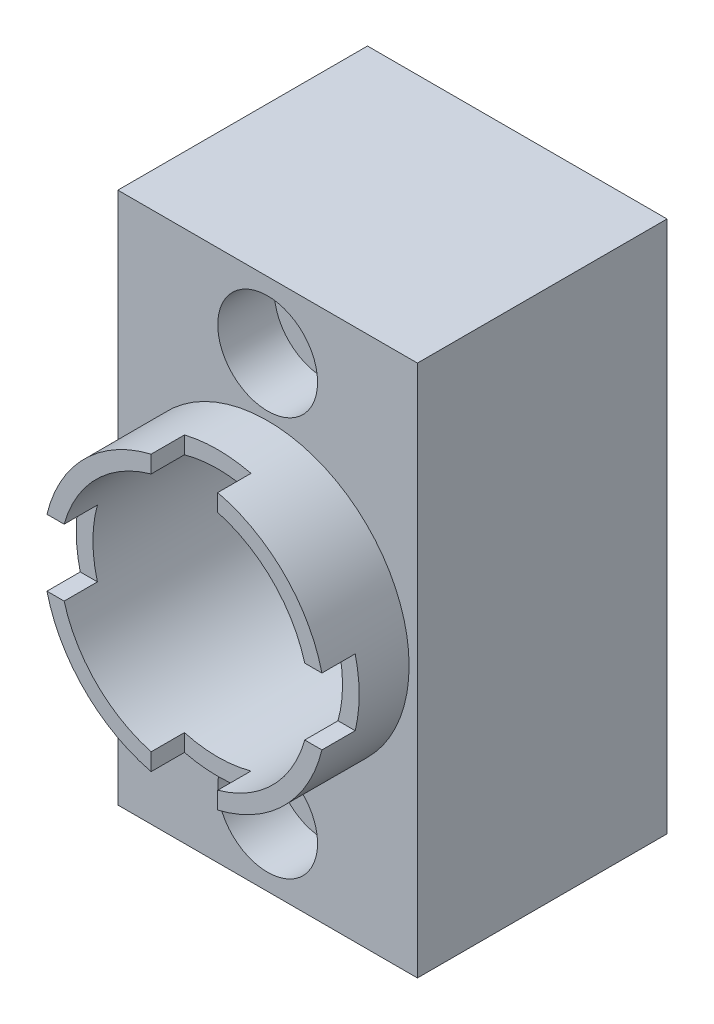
ISO-10303-21;
HEADER;
FILE_DESCRIPTION(('STEP AP214'),'2;1');
FILE_NAME('part.step','',(''),(''),'','','');
FILE_SCHEMA(('AUTOMOTIVE_DESIGN { 1 0 10303 214 1 1 1 1 }'));
ENDSEC;
DATA;
#1=APPLICATION_CONTEXT('core data for automotive mechanical design processes');
#2=APPLICATION_PROTOCOL_DEFINITION('international standard','automotive_design',2000,#1);
#3=PRODUCT_CONTEXT('',#1,'mechanical');
#4=PRODUCT('Part','Part','',(#3));
#5=PRODUCT_RELATED_PRODUCT_CATEGORY('part','',(#4));
#6=PRODUCT_DEFINITION_FORMATION('','',#4);
#7=PRODUCT_DEFINITION_CONTEXT('part definition',#1,'design');
#8=PRODUCT_DEFINITION('design','',#6,#7);
#9=PRODUCT_DEFINITION_SHAPE('','',#8);
#10=(LENGTH_UNIT() NAMED_UNIT(*) SI_UNIT(.MILLI.,.METRE.));
#11=(NAMED_UNIT(*) PLANE_ANGLE_UNIT() SI_UNIT($,.RADIAN.));
#12=(NAMED_UNIT(*) SI_UNIT($,.STERADIAN.) SOLID_ANGLE_UNIT());
#13=UNCERTAINTY_MEASURE_WITH_UNIT(LENGTH_MEASURE(1.E-05),#10,'distance_accuracy_value','');
#14=(GEOMETRIC_REPRESENTATION_CONTEXT(3) GLOBAL_UNCERTAINTY_ASSIGNED_CONTEXT((#13)) GLOBAL_UNIT_ASSIGNED_CONTEXT((#10,
#11,#12)) REPRESENTATION_CONTEXT('',''));
#15=CARTESIAN_POINT('',(0.,0.,0.));
#16=DIRECTION('',(0.,0.,1.));
#17=DIRECTION('',(1.,0.,0.));
#18=AXIS2_PLACEMENT_3D('',#15,#16,#17);
#19=CARTESIAN_POINT('',(0.,0.,20.));
#20=DIRECTION('',(0.,0.,-1.));
#21=DIRECTION('',(-1.,0.,0.));
#22=AXIS2_PLACEMENT_3D('',#19,#20,#21);
#23=PLANE('',#22);
#24=CARTESIAN_POINT('',(3.75000000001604,-1.20875531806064E-11,20.));
#25=DIRECTION('',(0.,0.,1.));
#26=DIRECTION('',(1.,0.,0.));
#27=AXIS2_PLACEMENT_3D('',#24,#25,#26);
#28=CIRCLE('',#27,8.49999999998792);
#29=CARTESIAN_POINT('',(12.0113558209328,1.99999999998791,20.));
#30=VERTEX_POINT('',#29);
#31=CARTESIAN_POINT('',(5.75000000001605,8.26135582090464,20.));
#32=VERTEX_POINT('',#31);
#33=EDGE_CURVE('E173',#30,#32,#28,.T.);
#34=ORIENTED_EDGE('',*,*,#33,.T.);
#35=DIRECTION('',(0.,1.,0.));
#36=VECTOR('',#35,1.);
#37=CARTESIAN_POINT('',(5.75000000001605,1.99999999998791,20.));
#38=LINE('',#37,#36);
#39=CARTESIAN_POINT('',(5.75000000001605,7.22841614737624,20.));
#40=VERTEX_POINT('',#39);
#41=EDGE_CURVE('E158',#40,#32,#38,.T.);
#42=ORIENTED_EDGE('',*,*,#41,.F.);
#43=CARTESIAN_POINT('',(3.75000000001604,-1.20875531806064E-11,20.));
#44=DIRECTION('',(0.,0.,1.));
#45=DIRECTION('',(1.,0.,0.));
#46=AXIS2_PLACEMENT_3D('',#43,#44,#45);
#47=CIRCLE('',#46,7.49999999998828);
#48=CARTESIAN_POINT('',(10.9784161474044,1.99999999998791,20.));
#49=VERTEX_POINT('',#48);
#50=EDGE_CURVE('E171',#49,#40,#47,.T.);
#51=ORIENTED_EDGE('',*,*,#50,.F.);
#52=DIRECTION('',(-1.,0.,0.));
#53=VECTOR('',#52,1.);
#54=CARTESIAN_POINT('',(5.75000000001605,1.99999999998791,20.));
#55=LINE('',#54,#53);
#56=EDGE_CURVE('E240',#30,#49,#55,.T.);
#57=ORIENTED_EDGE('',*,*,#56,.F.);
#58=EDGE_LOOP('',(#34,#42,#51,#57));
#59=FACE_BOUND('',#58,.T.);
#60=ADVANCED_FACE('F16',(#59),#23,.F.);
#61=CARTESIAN_POINT('',(5.75000000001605,-8.26135582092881,20.));
#62=VERTEX_POINT('',#61);
#63=CARTESIAN_POINT('',(12.0113558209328,-2.00000000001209,20.));
#64=VERTEX_POINT('',#63);
#65=EDGE_CURVE('E164',#62,#64,#28,.T.);
#66=ORIENTED_EDGE('',*,*,#65,.T.);
#67=DIRECTION('',(1.,0.,0.));
#68=VECTOR('',#67,1.);
#69=CARTESIAN_POINT('',(5.75000000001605,-2.00000000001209,20.));
#70=LINE('',#69,#68);
#71=CARTESIAN_POINT('',(10.9784161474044,-2.00000000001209,20.));
#72=VERTEX_POINT('',#71);
#73=EDGE_CURVE('E242',#72,#64,#70,.T.);
#74=ORIENTED_EDGE('',*,*,#73,.F.);
#75=CARTESIAN_POINT('',(5.75000000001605,-7.22841614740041,20.));
#76=VERTEX_POINT('',#75);
#77=EDGE_CURVE('E185',#76,#72,#47,.T.);
#78=ORIENTED_EDGE('',*,*,#77,.F.);
#79=DIRECTION('',(0.,1.,0.));
#80=VECTOR('',#79,1.);
#81=CARTESIAN_POINT('',(5.75000000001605,-9.47698460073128,20.));
#82=LINE('',#81,#80);
#83=EDGE_CURVE('E244',#62,#76,#82,.T.);
#84=ORIENTED_EDGE('',*,*,#83,.F.);
#85=EDGE_LOOP('',(#66,#74,#78,#84));
#86=FACE_BOUND('',#85,.T.);
#87=ADVANCED_FACE('F329',(#86),#23,.F.);
#88=CARTESIAN_POINT('',(-4.51135582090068,-2.00000000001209,20.));
#89=VERTEX_POINT('',#88);
#90=CARTESIAN_POINT('',(1.75000000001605,-8.26135582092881,20.));
#91=VERTEX_POINT('',#90);
#92=EDGE_CURVE('E365',#89,#91,#28,.T.);
#93=ORIENTED_EDGE('',*,*,#92,.T.);
#94=DIRECTION('',(0.,-1.,0.));
#95=VECTOR('',#94,1.);
#96=CARTESIAN_POINT('',(1.75000000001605,-9.47698460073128,20.));
#97=LINE('',#96,#95);
#98=CARTESIAN_POINT('',(1.75000000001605,-7.22841614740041,20.));
#99=VERTEX_POINT('',#98);
#100=EDGE_CURVE('E246',#99,#91,#97,.T.);
#101=ORIENTED_EDGE('',*,*,#100,.F.);
#102=CARTESIAN_POINT('',(-3.47841614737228,-2.00000000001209,20.));
#103=VERTEX_POINT('',#102);
#104=EDGE_CURVE('E190',#103,#99,#47,.T.);
#105=ORIENTED_EDGE('',*,*,#104,.F.);
#106=DIRECTION('',(1.,0.,0.));
#107=VECTOR('',#106,1.);
#108=CARTESIAN_POINT('',(-5.94728459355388,-2.00000000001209,20.));
#109=LINE('',#108,#107);
#110=EDGE_CURVE('E248',#89,#103,#109,.T.);
#111=ORIENTED_EDGE('',*,*,#110,.F.);
#112=EDGE_LOOP('',(#93,#101,#105,#111));
#113=FACE_BOUND('',#112,.T.);
#114=ADVANCED_FACE('F336',(#113),#23,.F.);
#115=CARTESIAN_POINT('',(12.7500000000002,-16.,20.));
#116=DIRECTION('',(-1.,0.,0.));
#117=DIRECTION('',(0.,0.,1.));
#118=AXIS2_PLACEMENT_3D('',#115,#116,#117);
#119=PLANE('',#118);
#120=DIRECTION('',(0.,0.,-1.));
#121=VECTOR('',#120,1.);
#122=CARTESIAN_POINT('',(12.7500000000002,16.,20.));
#123=LINE('',#122,#121);
#124=CARTESIAN_POINT('',(12.7500000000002,16.,15.));
#125=VERTEX_POINT('',#124);
#126=CARTESIAN_POINT('',(12.7500000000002,16.,0.));
#127=VERTEX_POINT('',#126);
#128=EDGE_CURVE('E437',#125,#127,#123,.T.);
#129=ORIENTED_EDGE('',*,*,#128,.F.);
#130=DIRECTION('',(0.,-1.,0.));
#131=VECTOR('',#130,1.);
#132=CARTESIAN_POINT('',(12.7500000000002,-16.,15.));
#133=LINE('',#132,#131);
#134=CARTESIAN_POINT('',(12.7500000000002,-16.,15.));
#135=VERTEX_POINT('',#134);
#136=EDGE_CURVE('E199',#125,#135,#133,.T.);
#137=ORIENTED_EDGE('',*,*,#136,.T.);
#138=DIRECTION('',(0.,0.,-1.));
#139=VECTOR('',#138,1.);
#140=CARTESIAN_POINT('',(12.7500000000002,-16.,20.));
#141=LINE('',#140,#139);
#142=CARTESIAN_POINT('',(12.7500000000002,-16.,0.));
#143=VERTEX_POINT('',#142);
#144=EDGE_CURVE('E431',#135,#143,#141,.T.);
#145=ORIENTED_EDGE('',*,*,#144,.T.);
#146=DIRECTION('',(0.,1.,0.));
#147=VECTOR('',#146,1.);
#148=CARTESIAN_POINT('',(12.7500000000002,-16.,0.));
#149=LINE('',#148,#147);
#150=EDGE_CURVE('E187',#143,#127,#149,.T.);
#151=ORIENTED_EDGE('',*,*,#150,.T.);
#152=EDGE_LOOP('',(#129,#137,#145,#151));
#153=FACE_BOUND('',#152,.T.);
#154=ADVANCED_FACE('F18',(#153),#119,.F.);
#155=CARTESIAN_POINT('',(-5.24999999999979,-16.,20.));
#156=DIRECTION('',(1.,0.,0.));
#157=DIRECTION('',(0.,0.,-1.));
#158=AXIS2_PLACEMENT_3D('',#155,#156,#157);
#159=PLANE('',#158);
#160=DIRECTION('',(0.,-1.,0.));
#161=VECTOR('',#160,1.);
#162=CARTESIAN_POINT('',(-5.24999999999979,-16.,15.));
#163=LINE('',#162,#161);
#164=CARTESIAN_POINT('',(-5.24999999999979,16.,15.));
#165=VERTEX_POINT('',#164);
#166=CARTESIAN_POINT('',(-5.24999999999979,-16.,15.));
#167=VERTEX_POINT('',#166);
#168=EDGE_CURVE('E205',#165,#167,#163,.T.);
#169=ORIENTED_EDGE('',*,*,#168,.F.);
#170=DIRECTION('',(0.,0.,-1.));
#171=VECTOR('',#170,1.);
#172=CARTESIAN_POINT('',(-5.24999999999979,16.,20.));
#173=LINE('',#172,#171);
#174=CARTESIAN_POINT('',(-5.24999999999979,16.,0.));
#175=VERTEX_POINT('',#174);
#176=EDGE_CURVE('E435',#165,#175,#173,.T.);
#177=ORIENTED_EDGE('',*,*,#176,.T.);
#178=DIRECTION('',(0.,-1.,0.));
#179=VECTOR('',#178,1.);
#180=CARTESIAN_POINT('',(-5.24999999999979,-16.,0.));
#181=LINE('',#180,#179);
#182=CARTESIAN_POINT('',(-5.24999999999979,-16.,0.));
#183=VERTEX_POINT('',#182);
#184=EDGE_CURVE('E425',#175,#183,#181,.T.);
#185=ORIENTED_EDGE('',*,*,#184,.T.);
#186=DIRECTION('',(0.,0.,-1.));
#187=VECTOR('',#186,1.);
#188=CARTESIAN_POINT('',(-5.24999999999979,-16.,20.));
#189=LINE('',#188,#187);
#190=EDGE_CURVE('E433',#167,#183,#189,.T.);
#191=ORIENTED_EDGE('',*,*,#190,.F.);
#192=EDGE_LOOP('',(#169,#177,#185,#191));
#193=FACE_BOUND('',#192,.T.);
#194=ADVANCED_FACE('F342',(#193),#159,.F.);
#195=CARTESIAN_POINT('',(1.75000000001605,8.26135582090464,20.));
#196=VERTEX_POINT('',#195);
#197=CARTESIAN_POINT('',(-4.51135582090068,1.99999999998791,20.));
#198=VERTEX_POINT('',#197);
#199=EDGE_CURVE('E214',#196,#198,#28,.T.);
#200=ORIENTED_EDGE('',*,*,#199,.T.);
#201=DIRECTION('',(-1.,0.,0.));
#202=VECTOR('',#201,1.);
#203=CARTESIAN_POINT('',(-5.94728459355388,1.99999999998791,20.));
#204=LINE('',#203,#202);
#205=CARTESIAN_POINT('',(-3.47841614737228,1.99999999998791,20.));
#206=VERTEX_POINT('',#205);
#207=EDGE_CURVE('E250',#206,#198,#204,.T.);
#208=ORIENTED_EDGE('',*,*,#207,.F.);
#209=CARTESIAN_POINT('',(1.75000000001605,7.22841614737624,20.));
#210=VERTEX_POINT('',#209);
#211=EDGE_CURVE('E183',#210,#206,#47,.T.);
#212=ORIENTED_EDGE('',*,*,#211,.F.);
#213=DIRECTION('',(0.,-1.,0.));
#214=VECTOR('',#213,1.);
#215=CARTESIAN_POINT('',(1.75000000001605,1.99999999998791,20.));
#216=LINE('',#215,#214);
#217=EDGE_CURVE('E174',#196,#210,#216,.T.);
#218=ORIENTED_EDGE('',*,*,#217,.F.);
#219=EDGE_LOOP('',(#200,#208,#212,#218));
#220=FACE_BOUND('',#219,.T.);
#221=ADVANCED_FACE('F331',(#220),#23,.F.);
#222=CARTESIAN_POINT('',(-5.24999999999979,16.,20.));
#223=DIRECTION('',(0.,-1.,0.));
#224=DIRECTION('',(0.,0.,-1.));
#225=AXIS2_PLACEMENT_3D('',#222,#223,#224);
#226=PLANE('',#225);
#227=ORIENTED_EDGE('',*,*,#176,.F.);
#228=DIRECTION('',(-1.,0.,0.));
#229=VECTOR('',#228,1.);
#230=CARTESIAN_POINT('',(12.7500000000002,16.,15.));
#231=LINE('',#230,#229);
#232=EDGE_CURVE('E208',#125,#165,#231,.T.);
#233=ORIENTED_EDGE('',*,*,#232,.F.);
#234=ORIENTED_EDGE('',*,*,#128,.T.);
#235=DIRECTION('',(-1.,0.,0.));
#236=VECTOR('',#235,1.);
#237=CARTESIAN_POINT('',(-5.24999999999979,16.,0.));
#238=LINE('',#237,#236);
#239=EDGE_CURVE('E423',#127,#175,#238,.T.);
#240=ORIENTED_EDGE('',*,*,#239,.T.);
#241=EDGE_LOOP('',(#227,#233,#234,#240));
#242=FACE_BOUND('',#241,.T.);
#243=ADVANCED_FACE('F341',(#242),#226,.F.);
#244=CARTESIAN_POINT('',(-5.24999999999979,-16.,20.));
#245=DIRECTION('',(0.,1.,0.));
#246=DIRECTION('',(0.,0.,1.));
#247=AXIS2_PLACEMENT_3D('',#244,#245,#246);
#248=PLANE('',#247);
#249=ORIENTED_EDGE('',*,*,#144,.F.);
#250=DIRECTION('',(-1.,0.,0.));
#251=VECTOR('',#250,1.);
#252=CARTESIAN_POINT('',(12.7500000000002,-16.,15.));
#253=LINE('',#252,#251);
#254=EDGE_CURVE('E193',#135,#167,#253,.T.);
#255=ORIENTED_EDGE('',*,*,#254,.T.);
#256=ORIENTED_EDGE('',*,*,#190,.T.);
#257=DIRECTION('',(1.,0.,0.));
#258=VECTOR('',#257,1.);
#259=CARTESIAN_POINT('',(-5.24999999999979,-16.,0.));
#260=LINE('',#259,#258);
#261=EDGE_CURVE('E421',#183,#143,#260,.T.);
#262=ORIENTED_EDGE('',*,*,#261,.T.);
#263=EDGE_LOOP('',(#249,#255,#256,#262));
#264=FACE_BOUND('',#263,.T.);
#265=ADVANCED_FACE('F349',(#264),#248,.F.);
#266=CARTESIAN_POINT('',(0.,0.,0.));
#267=DIRECTION('',(0.,0.,-1.));
#268=DIRECTION('',(-1.,0.,0.));
#269=AXIS2_PLACEMENT_3D('',#266,#267,#268);
#270=PLANE('',#269);
#271=CARTESIAN_POINT('',(3.75000000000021,-12.,0.));
#272=DIRECTION('',(0.,0.,-1.));
#273=DIRECTION('',(-1.,0.,0.));
#274=AXIS2_PLACEMENT_3D('',#271,#272,#273);
#275=CIRCLE('',#274,2.5);
#276=CARTESIAN_POINT('',(1.25000000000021,-12.,0.));
#277=VERTEX_POINT('',#276);
#278=EDGE_CURVE('E275',#277,#277,#275,.T.);
#279=ORIENTED_EDGE('',*,*,#278,.F.);
#280=EDGE_LOOP('',(#279));
#281=FACE_BOUND('',#280,.T.);
#282=CARTESIAN_POINT('',(3.75000000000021,12.,0.));
#283=DIRECTION('',(0.,0.,-1.));
#284=DIRECTION('',(-1.,0.,0.));
#285=AXIS2_PLACEMENT_3D('',#282,#283,#284);
#286=CIRCLE('',#285,2.5);
#287=CARTESIAN_POINT('',(1.25000000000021,12.,0.));
#288=VERTEX_POINT('',#287);
#289=EDGE_CURVE('E269',#288,#288,#286,.T.);
#290=ORIENTED_EDGE('',*,*,#289,.F.);
#291=EDGE_LOOP('',(#290));
#292=FACE_BOUND('',#291,.T.);
#293=CARTESIAN_POINT('',(3.75000000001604,-1.20875531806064E-11,0.));
#294=DIRECTION('',(0.,0.,1.));
#295=DIRECTION('',(1.,0.,0.));
#296=AXIS2_PLACEMENT_3D('',#293,#294,#295);
#297=CIRCLE('',#296,7.49999999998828);
#298=CARTESIAN_POINT('',(11.2500000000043,-1.20875531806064E-11,0.));
#299=VERTEX_POINT('',#298);
#300=EDGE_CURVE('E182',#299,#299,#297,.T.);
#301=ORIENTED_EDGE('',*,*,#300,.T.);
#302=EDGE_LOOP('',(#301));
#303=FACE_BOUND('',#302,.T.);
#304=ORIENTED_EDGE('',*,*,#150,.F.);
#305=ORIENTED_EDGE('',*,*,#261,.F.);
#306=ORIENTED_EDGE('',*,*,#184,.F.);
#307=ORIENTED_EDGE('',*,*,#239,.F.);
#308=EDGE_LOOP('',(#304,#305,#306,#307));
#309=FACE_BOUND('',#308,.T.);
#310=ADVANCED_FACE('F409',(#281,#292,#303,#309),#270,.T.);
#311=CARTESIAN_POINT('',(3.75000000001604,-1.20875531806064E-11,0.));
#312=DIRECTION('',(0.,0.,1.));
#313=DIRECTION('',(1.,0.,0.));
#314=AXIS2_PLACEMENT_3D('',#311,#312,#313);
#315=CYLINDRICAL_SURFACE('',#314,7.49999999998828);
#316=CARTESIAN_POINT('',(3.75000000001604,-1.20875531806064E-11,18.));
#317=DIRECTION('',(0.,0.,-1.));
#318=DIRECTION('',(-1.,0.,0.));
#319=AXIS2_PLACEMENT_3D('',#316,#317,#318);
#320=CIRCLE('',#319,7.49999999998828);
#321=CARTESIAN_POINT('',(1.75000000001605,-7.22841614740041,18.));
#322=VERTEX_POINT('',#321);
#323=CARTESIAN_POINT('',(5.75000000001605,-7.22841614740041,18.));
#324=VERTEX_POINT('',#323);
#325=EDGE_CURVE('E234',#322,#324,#320,.F.);
#326=ORIENTED_EDGE('',*,*,#325,.T.);
#327=DIRECTION('',(0.,0.,1.));
#328=VECTOR('',#327,1.);
#329=CARTESIAN_POINT('',(5.75000000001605,-7.22841614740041,0.));
#330=LINE('',#329,#328);
#331=EDGE_CURVE('E220',#324,#76,#330,.T.);
#332=ORIENTED_EDGE('',*,*,#331,.T.);
#333=ORIENTED_EDGE('',*,*,#77,.T.);
#334=DIRECTION('',(0.,0.,1.));
#335=VECTOR('',#334,1.);
#336=CARTESIAN_POINT('',(10.9784161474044,-2.00000000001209,0.));
#337=LINE('',#336,#335);
#338=CARTESIAN_POINT('',(10.9784161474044,-2.00000000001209,18.));
#339=VERTEX_POINT('',#338);
#340=EDGE_CURVE('E218',#72,#339,#337,.F.);
#341=ORIENTED_EDGE('',*,*,#340,.T.);
#342=CARTESIAN_POINT('',(10.9784161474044,1.99999999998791,18.));
#343=VERTEX_POINT('',#342);
#344=EDGE_CURVE('E457',#339,#343,#320,.F.);
#345=ORIENTED_EDGE('',*,*,#344,.T.);
#346=DIRECTION('',(0.,0.,1.));
#347=VECTOR('',#346,1.);
#348=CARTESIAN_POINT('',(10.9784161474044,1.99999999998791,0.));
#349=LINE('',#348,#347);
#350=EDGE_CURVE('E165',#343,#49,#349,.T.);
#351=ORIENTED_EDGE('',*,*,#350,.T.);
#352=ORIENTED_EDGE('',*,*,#50,.T.);
#353=DIRECTION('',(0.,0.,1.));
#354=VECTOR('',#353,1.);
#355=CARTESIAN_POINT('',(5.75000000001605,7.22841614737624,0.));
#356=LINE('',#355,#354);
#357=CARTESIAN_POINT('',(5.75000000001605,7.22841614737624,18.));
#358=VERTEX_POINT('',#357);
#359=EDGE_CURVE('E154',#40,#358,#356,.F.);
#360=ORIENTED_EDGE('',*,*,#359,.T.);
#361=CARTESIAN_POINT('',(1.75000000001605,7.22841614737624,18.));
#362=VERTEX_POINT('',#361);
#363=EDGE_CURVE('E238',#358,#362,#320,.F.);
#364=ORIENTED_EDGE('',*,*,#363,.T.);
#365=DIRECTION('',(0.,0.,1.));
#366=VECTOR('',#365,1.);
#367=CARTESIAN_POINT('',(1.75000000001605,7.22841614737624,0.));
#368=LINE('',#367,#366);
#369=EDGE_CURVE('E231',#362,#210,#368,.T.);
#370=ORIENTED_EDGE('',*,*,#369,.T.);
#371=ORIENTED_EDGE('',*,*,#211,.T.);
#372=DIRECTION('',(0.,0.,1.));
#373=VECTOR('',#372,1.);
#374=CARTESIAN_POINT('',(-3.47841614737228,1.99999999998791,0.));
#375=LINE('',#374,#373);
#376=CARTESIAN_POINT('',(-3.47841614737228,1.99999999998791,18.));
#377=VERTEX_POINT('',#376);
#378=EDGE_CURVE('E228',#206,#377,#375,.F.);
#379=ORIENTED_EDGE('',*,*,#378,.T.);
#380=CARTESIAN_POINT('',(-3.47841614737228,-2.00000000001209,18.));
#381=VERTEX_POINT('',#380);
#382=EDGE_CURVE('E235',#377,#381,#320,.F.);
#383=ORIENTED_EDGE('',*,*,#382,.T.);
#384=DIRECTION('',(0.,0.,1.));
#385=VECTOR('',#384,1.);
#386=CARTESIAN_POINT('',(-3.47841614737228,-2.00000000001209,0.));
#387=LINE('',#386,#385);
#388=EDGE_CURVE('E225',#381,#103,#387,.T.);
#389=ORIENTED_EDGE('',*,*,#388,.T.);
#390=ORIENTED_EDGE('',*,*,#104,.T.);
#391=DIRECTION('',(0.,0.,1.));
#392=VECTOR('',#391,1.);
#393=CARTESIAN_POINT('',(1.75000000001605,-7.22841614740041,0.));
#394=LINE('',#393,#392);
#395=EDGE_CURVE('E222',#99,#322,#394,.F.);
#396=ORIENTED_EDGE('',*,*,#395,.T.);
#397=EDGE_LOOP('',(#326,#332,#333,#341,#345,#351,#352,#360,#364,#370,#371,#379,#383,#389,#390,#396));
#398=FACE_BOUND('',#397,.T.);
#399=ORIENTED_EDGE('',*,*,#300,.F.);
#400=EDGE_LOOP('',(#399));
#401=FACE_BOUND('',#400,.T.);
#402=ADVANCED_FACE('F179',(#398,#401),#315,.F.);
#403=CARTESIAN_POINT('',(12.7500000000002,-16.,15.));
#404=DIRECTION('',(0.,0.,-1.));
#405=DIRECTION('',(-1.,0.,0.));
#406=AXIS2_PLACEMENT_3D('',#403,#404,#405);
#407=PLANE('',#406);
#408=CARTESIAN_POINT('',(3.75000000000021,-12.,15.));
#409=DIRECTION('',(0.,0.,1.));
#410=DIRECTION('',(1.,0.,0.));
#411=AXIS2_PLACEMENT_3D('',#408,#409,#410);
#412=CIRCLE('',#411,3.);
#413=CARTESIAN_POINT('',(6.75000000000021,-12.,15.));
#414=VERTEX_POINT('',#413);
#415=EDGE_CURVE('E296',#414,#414,#412,.T.);
#416=ORIENTED_EDGE('',*,*,#415,.F.);
#417=EDGE_LOOP('',(#416));
#418=FACE_BOUND('',#417,.T.);
#419=CARTESIAN_POINT('',(3.75000000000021,12.,15.));
#420=DIRECTION('',(0.,0.,1.));
#421=DIRECTION('',(1.,0.,0.));
#422=AXIS2_PLACEMENT_3D('',#419,#420,#421);
#423=CIRCLE('',#422,3.);
#424=CARTESIAN_POINT('',(6.75000000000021,12.,15.));
#425=VERTEX_POINT('',#424);
#426=EDGE_CURVE('E287',#425,#425,#423,.T.);
#427=ORIENTED_EDGE('',*,*,#426,.F.);
#428=EDGE_LOOP('',(#427));
#429=FACE_BOUND('',#428,.T.);
#430=ORIENTED_EDGE('',*,*,#168,.T.);
#431=ORIENTED_EDGE('',*,*,#254,.F.);
#432=ORIENTED_EDGE('',*,*,#136,.F.);
#433=ORIENTED_EDGE('',*,*,#232,.T.);
#434=EDGE_LOOP('',(#430,#431,#432,#433));
#435=FACE_BOUND('',#434,.T.);
#436=CARTESIAN_POINT('',(3.75000000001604,-1.20875531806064E-11,15.));
#437=DIRECTION('',(0.,0.,1.));
#438=DIRECTION('',(1.,0.,0.));
#439=AXIS2_PLACEMENT_3D('',#436,#437,#438);
#440=CIRCLE('',#439,8.49999999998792);
#441=CARTESIAN_POINT('',(12.250000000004,-1.20875531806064E-11,15.));
#442=VERTEX_POINT('',#441);
#443=EDGE_CURVE('E212',#442,#442,#440,.T.);
#444=ORIENTED_EDGE('',*,*,#443,.F.);
#445=EDGE_LOOP('',(#444));
#446=FACE_BOUND('',#445,.T.);
#447=ADVANCED_FACE('F302',(#418,#429,#435,#446),#407,.F.);
#448=CARTESIAN_POINT('',(3.75000000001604,-1.20875531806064E-11,15.));
#449=DIRECTION('',(0.,0.,1.));
#450=DIRECTION('',(1.,0.,0.));
#451=AXIS2_PLACEMENT_3D('',#448,#449,#450);
#452=CYLINDRICAL_SURFACE('',#451,8.49999999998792);
#453=DIRECTION('',(0.,0.,1.));
#454=VECTOR('',#453,1.);
#455=CARTESIAN_POINT('',(5.75000000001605,-8.26135582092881,15.));
#456=LINE('',#455,#454);
#457=CARTESIAN_POINT('',(5.75000000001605,-8.26135582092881,18.));
#458=VERTEX_POINT('',#457);
#459=EDGE_CURVE('E11',#458,#62,#456,.T.);
#460=ORIENTED_EDGE('',*,*,#459,.F.);
#461=CARTESIAN_POINT('',(3.75000000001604,-1.20875531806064E-11,18.));
#462=DIRECTION('',(0.,0.,-1.));
#463=DIRECTION('',(-1.,0.,0.));
#464=AXIS2_PLACEMENT_3D('',#461,#462,#463);
#465=CIRCLE('',#464,8.49999999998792);
#466=CARTESIAN_POINT('',(1.75000000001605,-8.26135582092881,18.));
#467=VERTEX_POINT('',#466);
#468=EDGE_CURVE('E382',#467,#458,#465,.F.);
#469=ORIENTED_EDGE('',*,*,#468,.F.);
#470=DIRECTION('',(0.,0.,1.));
#471=VECTOR('',#470,1.);
#472=CARTESIAN_POINT('',(1.75000000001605,-8.26135582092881,15.));
#473=LINE('',#472,#471);
#474=EDGE_CURVE('E25',#91,#467,#473,.F.);
#475=ORIENTED_EDGE('',*,*,#474,.F.);
#476=ORIENTED_EDGE('',*,*,#92,.F.);
#477=DIRECTION('',(0.,0.,1.));
#478=VECTOR('',#477,1.);
#479=CARTESIAN_POINT('',(-4.51135582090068,-2.00000000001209,15.));
#480=LINE('',#479,#478);
#481=CARTESIAN_POINT('',(-4.51135582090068,-2.00000000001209,18.));
#482=VERTEX_POINT('',#481);
#483=EDGE_CURVE('E443',#482,#89,#480,.T.);
#484=ORIENTED_EDGE('',*,*,#483,.F.);
#485=CARTESIAN_POINT('',(-4.51135582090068,1.99999999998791,18.));
#486=VERTEX_POINT('',#485);
#487=EDGE_CURVE('E438',#486,#482,#465,.F.);
#488=ORIENTED_EDGE('',*,*,#487,.F.);
#489=DIRECTION('',(0.,0.,1.));
#490=VECTOR('',#489,1.);
#491=CARTESIAN_POINT('',(-4.51135582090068,1.99999999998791,15.));
#492=LINE('',#491,#490);
#493=EDGE_CURVE('E440',#198,#486,#492,.F.);
#494=ORIENTED_EDGE('',*,*,#493,.F.);
#495=ORIENTED_EDGE('',*,*,#199,.F.);
#496=DIRECTION('',(0.,0.,1.));
#497=VECTOR('',#496,1.);
#498=CARTESIAN_POINT('',(1.75000000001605,8.26135582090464,15.));
#499=LINE('',#498,#497);
#500=CARTESIAN_POINT('',(1.75000000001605,8.26135582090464,18.));
#501=VERTEX_POINT('',#500);
#502=EDGE_CURVE('E444',#501,#196,#499,.T.);
#503=ORIENTED_EDGE('',*,*,#502,.F.);
#504=CARTESIAN_POINT('',(5.75000000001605,8.26135582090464,18.));
#505=VERTEX_POINT('',#504);
#506=EDGE_CURVE('E386',#505,#501,#465,.F.);
#507=ORIENTED_EDGE('',*,*,#506,.F.);
#508=DIRECTION('',(0.,0.,1.));
#509=VECTOR('',#508,1.);
#510=CARTESIAN_POINT('',(5.75000000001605,8.26135582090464,15.));
#511=LINE('',#510,#509);
#512=EDGE_CURVE('E384',#32,#505,#511,.F.);
#513=ORIENTED_EDGE('',*,*,#512,.F.);
#514=ORIENTED_EDGE('',*,*,#33,.F.);
#515=DIRECTION('',(0.,0.,1.));
#516=VECTOR('',#515,1.);
#517=CARTESIAN_POINT('',(12.0113558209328,1.99999999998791,15.));
#518=LINE('',#517,#516);
#519=CARTESIAN_POINT('',(12.0113558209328,1.99999999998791,18.));
#520=VERTEX_POINT('',#519);
#521=EDGE_CURVE('E380',#520,#30,#518,.T.);
#522=ORIENTED_EDGE('',*,*,#521,.F.);
#523=CARTESIAN_POINT('',(12.0113558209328,-2.00000000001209,18.));
#524=VERTEX_POINT('',#523);
#525=EDGE_CURVE('E378',#524,#520,#465,.F.);
#526=ORIENTED_EDGE('',*,*,#525,.F.);
#527=DIRECTION('',(0.,0.,1.));
#528=VECTOR('',#527,1.);
#529=CARTESIAN_POINT('',(12.0113558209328,-2.00000000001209,15.));
#530=LINE('',#529,#528);
#531=EDGE_CURVE('E376',#64,#524,#530,.F.);
#532=ORIENTED_EDGE('',*,*,#531,.F.);
#533=ORIENTED_EDGE('',*,*,#65,.F.);
#534=EDGE_LOOP('',(#460,#469,#475,#476,#484,#488,#494,#495,#503,#507,#513,#514,#522,#526,#532,#533));
#535=FACE_BOUND('',#534,.T.);
#536=ORIENTED_EDGE('',*,*,#443,.T.);
#537=EDGE_LOOP('',(#536));
#538=FACE_BOUND('',#537,.T.);
#539=ADVANCED_FACE('F305',(#535,#538),#452,.T.);
#540=CARTESIAN_POINT('',(0.,0.,18.));
#541=DIRECTION('',(0.,0.,-1.));
#542=DIRECTION('',(-1.,0.,0.));
#543=AXIS2_PLACEMENT_3D('',#540,#541,#542);
#544=PLANE('',#543);
#545=DIRECTION('',(-1.,0.,0.));
#546=VECTOR('',#545,1.);
#547=CARTESIAN_POINT('',(-5.94728459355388,1.99999999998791,18.));
#548=LINE('',#547,#546);
#549=EDGE_CURVE('E263',#377,#486,#548,.T.);
#550=ORIENTED_EDGE('',*,*,#549,.T.);
#551=ORIENTED_EDGE('',*,*,#487,.T.);
#552=DIRECTION('',(1.,0.,0.));
#553=VECTOR('',#552,1.);
#554=CARTESIAN_POINT('',(-5.94728459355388,-2.00000000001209,18.));
#555=LINE('',#554,#553);
#556=EDGE_CURVE('E260',#482,#381,#555,.T.);
#557=ORIENTED_EDGE('',*,*,#556,.T.);
#558=ORIENTED_EDGE('',*,*,#382,.F.);
#559=EDGE_LOOP('',(#550,#551,#557,#558));
#560=FACE_BOUND('',#559,.T.);
#561=ADVANCED_FACE('F313',(#560),#544,.F.);
#562=CARTESIAN_POINT('',(-5.94728459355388,1.99999999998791,18.));
#563=DIRECTION('',(0.,1.,0.));
#564=DIRECTION('',(0.,0.,1.));
#565=AXIS2_PLACEMENT_3D('',#562,#563,#564);
#566=PLANE('',#565);
#567=ORIENTED_EDGE('',*,*,#207,.T.);
#568=ORIENTED_EDGE('',*,*,#493,.T.);
#569=ORIENTED_EDGE('',*,*,#549,.F.);
#570=ORIENTED_EDGE('',*,*,#378,.F.);
#571=EDGE_LOOP('',(#567,#568,#569,#570));
#572=FACE_BOUND('',#571,.T.);
#573=ADVANCED_FACE('F321',(#572),#566,.F.);
#574=CARTESIAN_POINT('',(-5.94728459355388,-2.00000000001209,18.));
#575=DIRECTION('',(0.,-1.,0.));
#576=DIRECTION('',(0.,0.,-1.));
#577=AXIS2_PLACEMENT_3D('',#574,#575,#576);
#578=PLANE('',#577);
#579=ORIENTED_EDGE('',*,*,#556,.F.);
#580=ORIENTED_EDGE('',*,*,#483,.T.);
#581=ORIENTED_EDGE('',*,*,#110,.T.);
#582=ORIENTED_EDGE('',*,*,#388,.F.);
#583=EDGE_LOOP('',(#579,#580,#581,#582));
#584=FACE_BOUND('',#583,.T.);
#585=ADVANCED_FACE('F477',(#584),#578,.F.);
#586=DIRECTION('',(0.,1.,0.));
#587=VECTOR('',#586,1.);
#588=CARTESIAN_POINT('',(5.75000000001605,1.99999999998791,18.));
#589=LINE('',#588,#587);
#590=EDGE_CURVE('E160',#358,#505,#589,.T.);
#591=ORIENTED_EDGE('',*,*,#590,.T.);
#592=ORIENTED_EDGE('',*,*,#506,.T.);
#593=DIRECTION('',(0.,-1.,0.));
#594=VECTOR('',#593,1.);
#595=CARTESIAN_POINT('',(1.75000000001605,1.99999999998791,18.));
#596=LINE('',#595,#594);
#597=EDGE_CURVE('E265',#501,#362,#596,.T.);
#598=ORIENTED_EDGE('',*,*,#597,.T.);
#599=ORIENTED_EDGE('',*,*,#363,.F.);
#600=EDGE_LOOP('',(#591,#592,#598,#599));
#601=FACE_BOUND('',#600,.T.);
#602=ADVANCED_FACE('F325',(#601),#544,.F.);
#603=CARTESIAN_POINT('',(1.75000000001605,1.99999999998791,18.));
#604=DIRECTION('',(-1.,0.,0.));
#605=DIRECTION('',(0.,0.,1.));
#606=AXIS2_PLACEMENT_3D('',#603,#604,#605);
#607=PLANE('',#606);
#608=ORIENTED_EDGE('',*,*,#597,.F.);
#609=ORIENTED_EDGE('',*,*,#502,.T.);
#610=ORIENTED_EDGE('',*,*,#217,.T.);
#611=ORIENTED_EDGE('',*,*,#369,.F.);
#612=EDGE_LOOP('',(#608,#609,#610,#611));
#613=FACE_BOUND('',#612,.T.);
#614=ADVANCED_FACE('F451',(#613),#607,.F.);
#615=CARTESIAN_POINT('',(5.75000000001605,1.99999999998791,18.));
#616=DIRECTION('',(1.,0.,0.));
#617=DIRECTION('',(0.,0.,-1.));
#618=AXIS2_PLACEMENT_3D('',#615,#616,#617);
#619=PLANE('',#618);
#620=ORIENTED_EDGE('',*,*,#41,.T.);
#621=ORIENTED_EDGE('',*,*,#512,.T.);
#622=ORIENTED_EDGE('',*,*,#590,.F.);
#623=ORIENTED_EDGE('',*,*,#359,.F.);
#624=EDGE_LOOP('',(#620,#621,#622,#623));
#625=FACE_BOUND('',#624,.T.);
#626=ADVANCED_FACE('F156',(#625),#619,.F.);
#627=DIRECTION('',(1.,0.,0.));
#628=VECTOR('',#627,1.);
#629=CARTESIAN_POINT('',(5.75000000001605,-2.00000000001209,18.));
#630=LINE('',#629,#628);
#631=EDGE_CURVE('E41',#339,#524,#630,.T.);
#632=ORIENTED_EDGE('',*,*,#631,.T.);
#633=ORIENTED_EDGE('',*,*,#525,.T.);
#634=DIRECTION('',(-1.,0.,0.));
#635=VECTOR('',#634,1.);
#636=CARTESIAN_POINT('',(5.75000000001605,1.99999999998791,18.));
#637=LINE('',#636,#635);
#638=EDGE_CURVE('E239',#520,#343,#637,.T.);
#639=ORIENTED_EDGE('',*,*,#638,.T.);
#640=ORIENTED_EDGE('',*,*,#344,.F.);
#641=EDGE_LOOP('',(#632,#633,#639,#640));
#642=FACE_BOUND('',#641,.T.);
#643=ADVANCED_FACE('F486',(#642),#544,.F.);
#644=CARTESIAN_POINT('',(5.75000000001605,-2.00000000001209,18.));
#645=DIRECTION('',(0.,-1.,0.));
#646=DIRECTION('',(0.,0.,-1.));
#647=AXIS2_PLACEMENT_3D('',#644,#645,#646);
#648=PLANE('',#647);
#649=ORIENTED_EDGE('',*,*,#73,.T.);
#650=ORIENTED_EDGE('',*,*,#531,.T.);
#651=ORIENTED_EDGE('',*,*,#631,.F.);
#652=ORIENTED_EDGE('',*,*,#340,.F.);
#653=EDGE_LOOP('',(#649,#650,#651,#652));
#654=FACE_BOUND('',#653,.T.);
#655=ADVANCED_FACE('F472',(#654),#648,.F.);
#656=CARTESIAN_POINT('',(5.75000000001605,1.99999999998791,18.));
#657=DIRECTION('',(0.,1.,0.));
#658=DIRECTION('',(0.,0.,1.));
#659=AXIS2_PLACEMENT_3D('',#656,#657,#658);
#660=PLANE('',#659);
#661=ORIENTED_EDGE('',*,*,#638,.F.);
#662=ORIENTED_EDGE('',*,*,#521,.T.);
#663=ORIENTED_EDGE('',*,*,#56,.T.);
#664=ORIENTED_EDGE('',*,*,#350,.F.);
#665=EDGE_LOOP('',(#661,#662,#663,#664));
#666=FACE_BOUND('',#665,.T.);
#667=ADVANCED_FACE('F464',(#666),#660,.F.);
#668=CARTESIAN_POINT('',(5.75000000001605,-9.47698460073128,18.));
#669=DIRECTION('',(1.,0.,0.));
#670=DIRECTION('',(0.,0.,-1.));
#671=AXIS2_PLACEMENT_3D('',#668,#669,#670);
#672=PLANE('',#671);
#673=DIRECTION('',(0.,1.,0.));
#674=VECTOR('',#673,1.);
#675=CARTESIAN_POINT('',(5.75000000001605,-9.47698460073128,18.));
#676=LINE('',#675,#674);
#677=EDGE_CURVE('E256',#458,#324,#676,.T.);
#678=ORIENTED_EDGE('',*,*,#677,.F.);
#679=ORIENTED_EDGE('',*,*,#459,.T.);
#680=ORIENTED_EDGE('',*,*,#83,.T.);
#681=ORIENTED_EDGE('',*,*,#331,.F.);
#682=EDGE_LOOP('',(#678,#679,#680,#681));
#683=FACE_BOUND('',#682,.T.);
#684=ADVANCED_FACE('F462',(#683),#672,.F.);
#685=CARTESIAN_POINT('',(1.75000000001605,-9.47698460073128,18.));
#686=DIRECTION('',(-1.,0.,0.));
#687=DIRECTION('',(0.,0.,1.));
#688=AXIS2_PLACEMENT_3D('',#685,#686,#687);
#689=PLANE('',#688);
#690=ORIENTED_EDGE('',*,*,#100,.T.);
#691=ORIENTED_EDGE('',*,*,#474,.T.);
#692=DIRECTION('',(0.,-1.,0.));
#693=VECTOR('',#692,1.);
#694=CARTESIAN_POINT('',(1.75000000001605,-9.47698460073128,18.));
#695=LINE('',#694,#693);
#696=EDGE_CURVE('E33',#322,#467,#695,.T.);
#697=ORIENTED_EDGE('',*,*,#696,.F.);
#698=ORIENTED_EDGE('',*,*,#395,.F.);
#699=EDGE_LOOP('',(#690,#691,#697,#698));
#700=FACE_BOUND('',#699,.T.);
#701=ADVANCED_FACE('F460',(#700),#689,.F.);
#702=ORIENTED_EDGE('',*,*,#696,.T.);
#703=ORIENTED_EDGE('',*,*,#468,.T.);
#704=ORIENTED_EDGE('',*,*,#677,.T.);
#705=ORIENTED_EDGE('',*,*,#325,.F.);
#706=EDGE_LOOP('',(#702,#703,#704,#705));
#707=FACE_BOUND('',#706,.T.);
#708=ADVANCED_FACE('F324',(#707),#544,.F.);
#709=CARTESIAN_POINT('',(3.75000000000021,12.,2.));
#710=DIRECTION('',(0.,0.,-1.));
#711=DIRECTION('',(-1.,0.,0.));
#712=AXIS2_PLACEMENT_3D('',#709,#710,#711);
#713=CYLINDRICAL_SURFACE('',#712,2.5);
#714=CARTESIAN_POINT('',(3.75000000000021,12.,2.));
#715=DIRECTION('',(0.,0.,-1.));
#716=DIRECTION('',(-1.,0.,0.));
#717=AXIS2_PLACEMENT_3D('',#714,#715,#716);
#718=CIRCLE('',#717,2.5);
#719=CARTESIAN_POINT('',(1.25000000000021,12.,2.));
#720=VERTEX_POINT('',#719);
#721=EDGE_CURVE('E175',#720,#720,#718,.T.);
#722=ORIENTED_EDGE('',*,*,#721,.F.);
#723=EDGE_LOOP('',(#722));
#724=FACE_BOUND('',#723,.T.);
#725=ORIENTED_EDGE('',*,*,#289,.T.);
#726=EDGE_LOOP('',(#725));
#727=FACE_BOUND('',#726,.T.);
#728=ADVANCED_FACE('F400',(#724,#727),#713,.F.);
#729=CARTESIAN_POINT('',(3.75000000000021,12.,2.));
#730=DIRECTION('',(0.,0.,-1.));
#731=DIRECTION('',(-1.,0.,0.));
#732=AXIS2_PLACEMENT_3D('',#729,#730,#731);
#733=PLANE('',#732);
#734=CARTESIAN_POINT('',(3.75000000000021,12.,2.));
#735=DIRECTION('',(0.,0.,-1.));
#736=DIRECTION('',(-1.,0.,0.));
#737=AXIS2_PLACEMENT_3D('',#734,#735,#736);
#738=CIRCLE('',#737,1.7);
#739=CARTESIAN_POINT('',(2.05000000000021,12.,2.));
#740=VERTEX_POINT('',#739);
#741=EDGE_CURVE('E278',#740,#740,#738,.T.);
#742=ORIENTED_EDGE('',*,*,#741,.F.);
#743=EDGE_LOOP('',(#742));
#744=FACE_BOUND('',#743,.T.);
#745=ORIENTED_EDGE('',*,*,#721,.T.);
#746=EDGE_LOOP('',(#745));
#747=FACE_BOUND('',#746,.T.);
#748=ADVANCED_FACE('F396',(#744,#747),#733,.T.);
#749=CARTESIAN_POINT('',(3.75000000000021,-12.,2.));
#750=DIRECTION('',(0.,0.,-1.));
#751=DIRECTION('',(-1.,0.,0.));
#752=AXIS2_PLACEMENT_3D('',#749,#750,#751);
#753=CYLINDRICAL_SURFACE('',#752,2.5);
#754=CARTESIAN_POINT('',(3.75000000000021,-12.,2.));
#755=DIRECTION('',(0.,0.,-1.));
#756=DIRECTION('',(-1.,0.,0.));
#757=AXIS2_PLACEMENT_3D('',#754,#755,#756);
#758=CIRCLE('',#757,2.5);
#759=CARTESIAN_POINT('',(1.25000000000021,-12.,2.));
#760=VERTEX_POINT('',#759);
#761=EDGE_CURVE('E272',#760,#760,#758,.T.);
#762=ORIENTED_EDGE('',*,*,#761,.F.);
#763=EDGE_LOOP('',(#762));
#764=FACE_BOUND('',#763,.T.);
#765=ORIENTED_EDGE('',*,*,#278,.T.);
#766=EDGE_LOOP('',(#765));
#767=FACE_BOUND('',#766,.T.);
#768=ADVANCED_FACE('F399',(#764,#767),#753,.F.);
#769=CARTESIAN_POINT('',(3.75000000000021,-12.,2.));
#770=DIRECTION('',(0.,0.,-1.));
#771=DIRECTION('',(-1.,0.,0.));
#772=AXIS2_PLACEMENT_3D('',#769,#770,#771);
#773=PLANE('',#772);
#774=CARTESIAN_POINT('',(3.75000000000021,-12.,2.));
#775=DIRECTION('',(0.,0.,-1.));
#776=DIRECTION('',(-1.,0.,0.));
#777=AXIS2_PLACEMENT_3D('',#774,#775,#776);
#778=CIRCLE('',#777,1.7);
#779=CARTESIAN_POINT('',(2.05000000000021,-12.,2.));
#780=VERTEX_POINT('',#779);
#781=EDGE_CURVE('E20',#780,#780,#778,.T.);
#782=ORIENTED_EDGE('',*,*,#781,.F.);
#783=EDGE_LOOP('',(#782));
#784=FACE_BOUND('',#783,.T.);
#785=ORIENTED_EDGE('',*,*,#761,.T.);
#786=EDGE_LOOP('',(#785));
#787=FACE_BOUND('',#786,.T.);
#788=ADVANCED_FACE('F523',(#784,#787),#773,.T.);
#789=CARTESIAN_POINT('',(3.75000000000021,12.,15.));
#790=DIRECTION('',(0.,0.,1.));
#791=DIRECTION('',(1.,0.,0.));
#792=AXIS2_PLACEMENT_3D('',#789,#790,#791);
#793=CYLINDRICAL_SURFACE('',#792,1.7);
#794=ORIENTED_EDGE('',*,*,#741,.T.);
#795=EDGE_LOOP('',(#794));
#796=FACE_BOUND('',#795,.T.);
#797=CARTESIAN_POINT('',(3.75000000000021,12.,11.6));
#798=DIRECTION('',(0.,0.,1.));
#799=DIRECTION('',(1.,0.,0.));
#800=AXIS2_PLACEMENT_3D('',#797,#798,#799);
#801=CIRCLE('',#800,1.7);
#802=CARTESIAN_POINT('',(5.45000000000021,12.,11.6));
#803=VERTEX_POINT('',#802);
#804=EDGE_CURVE('E281',#803,#803,#801,.T.);
#805=ORIENTED_EDGE('',*,*,#804,.T.);
#806=EDGE_LOOP('',(#805));
#807=FACE_BOUND('',#806,.T.);
#808=ADVANCED_FACE('F393',(#796,#807),#793,.F.);
#809=CARTESIAN_POINT('',(5.45000000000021,12.,11.6));
#810=DIRECTION('',(0.,0.,-1.));
#811=DIRECTION('',(-1.,0.,0.));
#812=AXIS2_PLACEMENT_3D('',#809,#810,#811);
#813=PLANE('',#812);
#814=ORIENTED_EDGE('',*,*,#804,.F.);
#815=EDGE_LOOP('',(#814));
#816=FACE_BOUND('',#815,.T.);
#817=CARTESIAN_POINT('',(3.75000000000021,12.,11.6));
#818=DIRECTION('',(0.,0.,1.));
#819=DIRECTION('',(1.,0.,0.));
#820=AXIS2_PLACEMENT_3D('',#817,#818,#819);
#821=CIRCLE('',#820,3.);
#822=CARTESIAN_POINT('',(6.75000000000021,12.,11.6));
#823=VERTEX_POINT('',#822);
#824=EDGE_CURVE('E284',#823,#823,#821,.T.);
#825=ORIENTED_EDGE('',*,*,#824,.T.);
#826=EDGE_LOOP('',(#825));
#827=FACE_BOUND('',#826,.T.);
#828=ADVANCED_FACE('F540',(#816,#827),#813,.F.);
#829=CARTESIAN_POINT('',(3.75000000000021,12.,15.));
#830=DIRECTION('',(0.,0.,1.));
#831=DIRECTION('',(1.,0.,0.));
#832=AXIS2_PLACEMENT_3D('',#829,#830,#831);
#833=CYLINDRICAL_SURFACE('',#832,3.);
#834=ORIENTED_EDGE('',*,*,#824,.F.);
#835=EDGE_LOOP('',(#834));
#836=FACE_BOUND('',#835,.T.);
#837=ORIENTED_EDGE('',*,*,#426,.T.);
#838=EDGE_LOOP('',(#837));
#839=FACE_BOUND('',#838,.T.);
#840=ADVANCED_FACE('F548',(#836,#839),#833,.F.);
#841=CARTESIAN_POINT('',(3.75000000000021,-12.,15.));
#842=DIRECTION('',(0.,0.,1.));
#843=DIRECTION('',(1.,0.,0.));
#844=AXIS2_PLACEMENT_3D('',#841,#842,#843);
#845=CYLINDRICAL_SURFACE('',#844,1.7);
#846=ORIENTED_EDGE('',*,*,#781,.T.);
#847=EDGE_LOOP('',(#846));
#848=FACE_BOUND('',#847,.T.);
#849=CARTESIAN_POINT('',(3.75000000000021,-12.,11.6));
#850=DIRECTION('',(0.,0.,1.));
#851=DIRECTION('',(1.,0.,0.));
#852=AXIS2_PLACEMENT_3D('',#849,#850,#851);
#853=CIRCLE('',#852,1.7);
#854=CARTESIAN_POINT('',(5.45000000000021,-12.,11.6));
#855=VERTEX_POINT('',#854);
#856=EDGE_CURVE('E290',#855,#855,#853,.T.);
#857=ORIENTED_EDGE('',*,*,#856,.T.);
#858=EDGE_LOOP('',(#857));
#859=FACE_BOUND('',#858,.T.);
#860=ADVANCED_FACE('F557',(#848,#859),#845,.F.);
#861=CARTESIAN_POINT('',(5.45000000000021,-12.,11.6));
#862=DIRECTION('',(0.,0.,-1.));
#863=DIRECTION('',(-1.,0.,0.));
#864=AXIS2_PLACEMENT_3D('',#861,#862,#863);
#865=PLANE('',#864);
#866=ORIENTED_EDGE('',*,*,#856,.F.);
#867=EDGE_LOOP('',(#866));
#868=FACE_BOUND('',#867,.T.);
#869=CARTESIAN_POINT('',(3.75000000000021,-12.,11.6));
#870=DIRECTION('',(0.,0.,1.));
#871=DIRECTION('',(1.,0.,0.));
#872=AXIS2_PLACEMENT_3D('',#869,#870,#871);
#873=CIRCLE('',#872,3.);
#874=CARTESIAN_POINT('',(6.75000000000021,-12.,11.6));
#875=VERTEX_POINT('',#874);
#876=EDGE_CURVE('E293',#875,#875,#873,.T.);
#877=ORIENTED_EDGE('',*,*,#876,.T.);
#878=EDGE_LOOP('',(#877));
#879=FACE_BOUND('',#878,.T.);
#880=ADVANCED_FACE('F566',(#868,#879),#865,.F.);
#881=CARTESIAN_POINT('',(3.75000000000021,-12.,15.));
#882=DIRECTION('',(0.,0.,1.));
#883=DIRECTION('',(1.,0.,0.));
#884=AXIS2_PLACEMENT_3D('',#881,#882,#883);
#885=CYLINDRICAL_SURFACE('',#884,3.);
#886=ORIENTED_EDGE('',*,*,#876,.F.);
#887=EDGE_LOOP('',(#886));
#888=FACE_BOUND('',#887,.T.);
#889=ORIENTED_EDGE('',*,*,#415,.T.);
#890=EDGE_LOOP('',(#889));
#891=FACE_BOUND('',#890,.T.);
#892=ADVANCED_FACE('F300',(#888,#891),#885,.F.);
#893=CLOSED_SHELL('',(#60,#87,#114,#154,#194,#221,#243,#265,#310,#402,#447,#539,#561,#573,#585,
#602,#614,#626,#643,#655,#667,#684,#701,#708,#728,#748,#768,#788,#808,#828,#840,#860,#880,#892));
#894=MANIFOLD_SOLID_BREP('B1',#893);
#895=ADVANCED_BREP_SHAPE_REPRESENTATION('',(#18,#894),#14);
#896=SHAPE_DEFINITION_REPRESENTATION(#9,#895);
ENDSEC;
END-ISO-10303-21;
